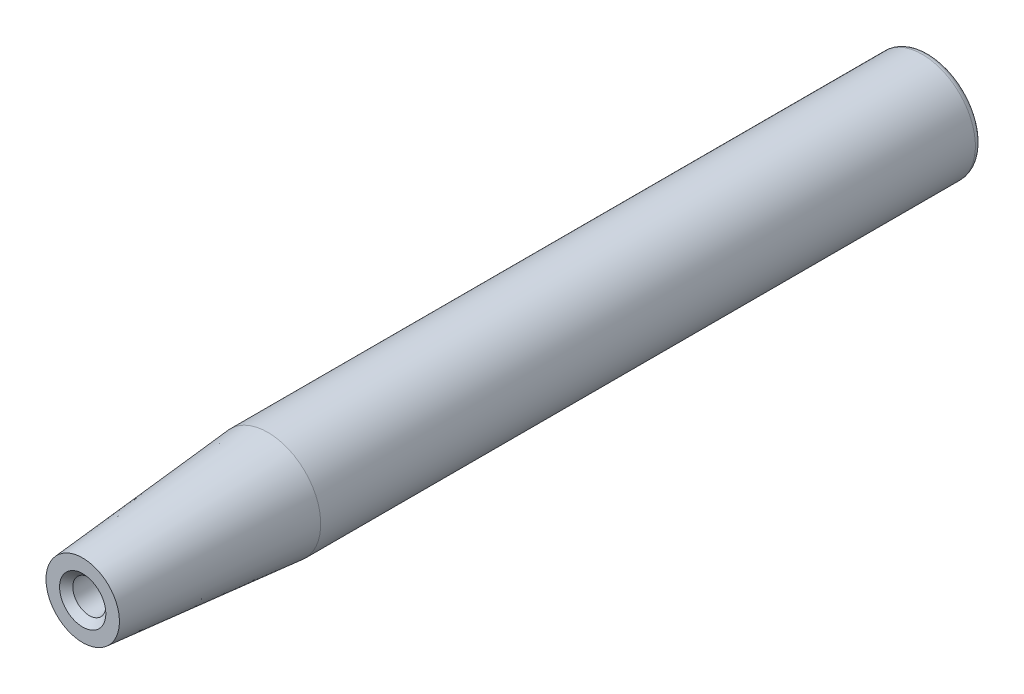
from build123d import *

# Parameters (mm, degrees)
CONG_1_R       = 1
FIXATION_D     = 5
FIXATION_DEPTH = 17
FIXATION_TIP   = 1.502151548
CHANF_1_SIZE   = 1


with BuildPart() as part:
    # Esquisse1 → Colonne (revolve)
    with BuildSketch(Plane(origin=(0, 0, 0), x_dir=(1, 0, 0), z_dir=(0, 1, 0))):
        Polygon((0, 100), (-8, 100), (-8, 0), (-5.550317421, -28), (0, -28), align=None)
    revolve(axis=Axis((0, 0, -103.163187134), (0, 0, 1)))

    # Cong_ 1
    cong_1_edges = [part.edges().sort_by_distance(p)[0] for p in [
        (8, 0, -100),
    ]]
    fillet(cong_1_edges, radius=CONG_1_R)

    # Fixation
    with Locations(Plane.XY.offset(28)):
        with Locations((0, 0)):
            Hole(FIXATION_D / 2, depth=FIXATION_DEPTH)
            with Locations((0, 0, -(FIXATION_DEPTH + FIXATION_TIP / 2))):  # 118° drill point
                Cone(0, FIXATION_D / 2, FIXATION_TIP, mode=Mode.SUBTRACT)

    # Chanf 1
    chanf_1_edges = [part.edges().sort_by_distance(p)[0] for p in [
        (2.5, 0, 28),
    ]]
    chamfer(chanf_1_edges, length=CHANF_1_SIZE)


solid = part.part
